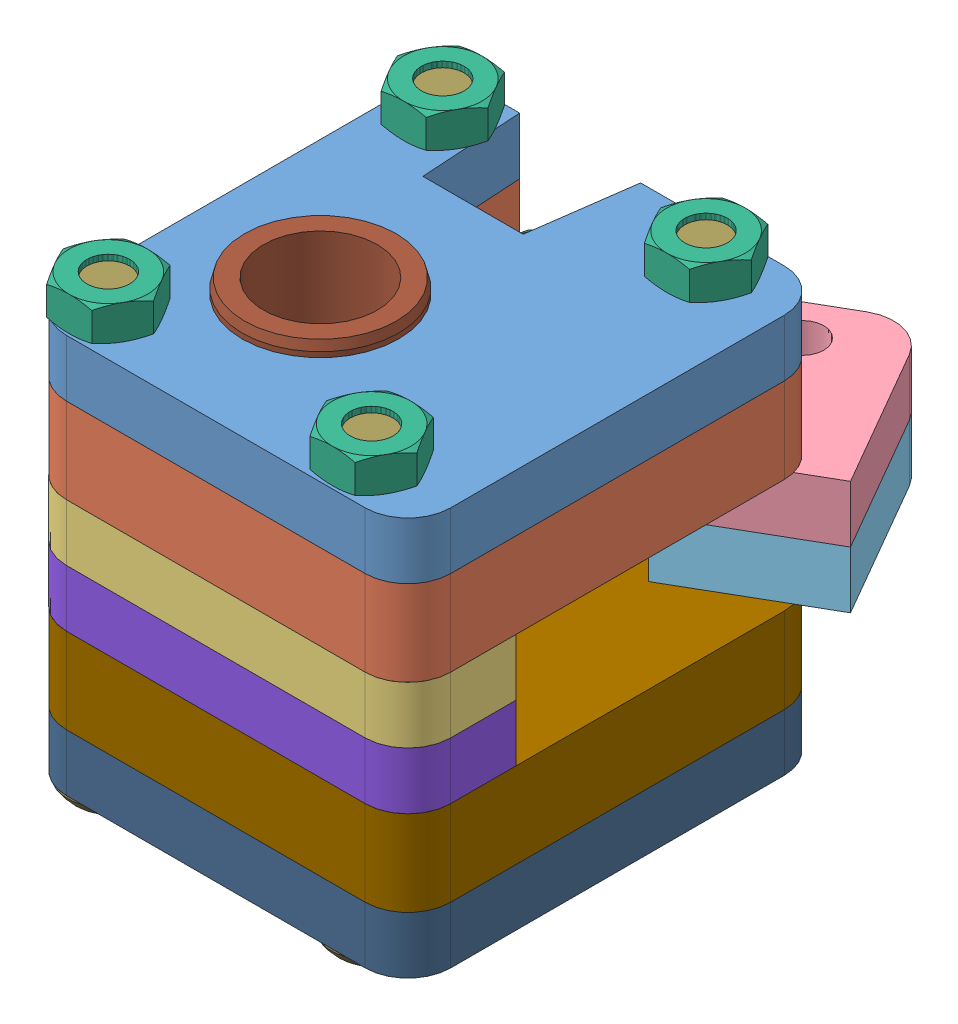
SolidWorks assembly UM_3030_ASM.sldasm, configuration Default (file format 5000). Lengths in mm.
Overall size (38.33 32.3 41.05).
23 component instances, 12 part files, 0 mates.
Components (placement in the parent):
- UM_3031-1: UM_3031.sldprt [Default] at origin size (27 4 29.45)
- UM_3032-1: UM_3032.sldprt [Default] at (0 -5 0) size (27 6 29.45)
- UM_3033-1: UM_3033.sldprt [Default] at (0 -10 0) size (35.9 4.01 23.45)
- UM_3040_ASM-1: UM_3040_ASM.sldasm [Default] at (3.3732 -10 -6.1959) x (0.866025 0 -0.5) z (0.5 0 0.866025) size (27 19.5 14.3)
  - UM_3041-1: UM_3041.sldprt [Default] at origin size (27 4 14.3)
  - UM_3042-1: UM_3042.sldprt [Default] at (0 -4 0) size (27 4 14.3)
  - DIN934_M3-1: DIN934_M3.sldprt [Default] at (-3.05 -8.4 -8.125) x (-1 0 0) z (0 1 0) size (6.35 5.5 2.4)
  - DIN934_M3-2: DIN934_M3.sldprt [Default] at (-3.05 -10.8 -8.125) x (-1 0 0) z (0 1 0) size (6.35 5.5 2.4)
  - DIN934_M3-3: DIN934_M3.sldprt [Default] at (-3.05 4.4 -8.125) x (1 0 0) z (0 -1 0) size (6.35 5.5 2.4)
  - DIN934_M3-4: DIN934_M3.sldprt [Default] at (-3.05 6.8 -8.125) x (1 0 0) z (0 -1 0) size (6.35 5.5 2.4)
  - ISO7380_M3X16-1: ISO7380_M3X16.sldprt [Default] at (-3.05 -10.8 -8.125) x (-1 0 0) z (0 0 1) size (5.77 17.9 5.75)
- UM_3035-1: UM_3035.sldprt [Default] at (0 -14 0) size (35.9 4.01 23.45)
- UM_3037-1: UM_3037.sldprt [Default] at (0 -19 0) size (27 6 29.45)
- UM_3038-1: UM_3038.sldprt [Default] at (0 -24 0) size (27 4 29.45)
- SLIDE_BEARING_8X11X30-1: SLIDE_BEARING_8X11X30.sldprt [Default] at (-4.1 -12 3.275) x (0 1 0) z (0 0 1) size (30 11 11)
- ISO7380_M3X30-1: ISO7380_M3X30.sldprt [Default] at (-10.5 -26 11.775) x (-1 0 0) z (0 0 1) size (5.77 31.9 5.75)
- ISO7380_M3X30-2: ISO7380_M3X30.sldprt [Default] at (8 -26 11.775) x (-1 0 0) z (0 0 1) size (5.77 31.9 5.75)
- DIN934_M3-1: DIN934_M3.sldprt [Default] at (8 4.4 11.775) x (1 0 0) z (0 -1 0) size (6.35 5.5 2.4)
- DIN934_M3-2: DIN934_M3.sldprt [Default] at (-10.5 4.4 11.775) x (1 0 0) z (0 -1 0) size (6.35 5.5 2.4)
- ISO7380_M3X30-3: ISO7380_M3X30.sldprt [Default] at (-10.5 -26 -11.725) x (-1 0 0) z (0 0 1) size (5.77 31.9 5.75)
- DIN934_M3-3: DIN934_M3.sldprt [Default] at (-10.5 4.4 -11.725) x (1 0 0) z (0 -1 0) size (6.35 5.5 2.4)
- ISO7380_M3X30-4: ISO7380_M3X30.sldprt [Default] at (8 -26 -11.725) x (-1 0 0) z (0 0 1) size (5.77 31.9 5.75)
- DIN934_M3-4: DIN934_M3.sldprt [Default] at (8 4.4 -11.725) x (1 0 0) z (0 -1 0) size (6.35 5.5 2.4)
